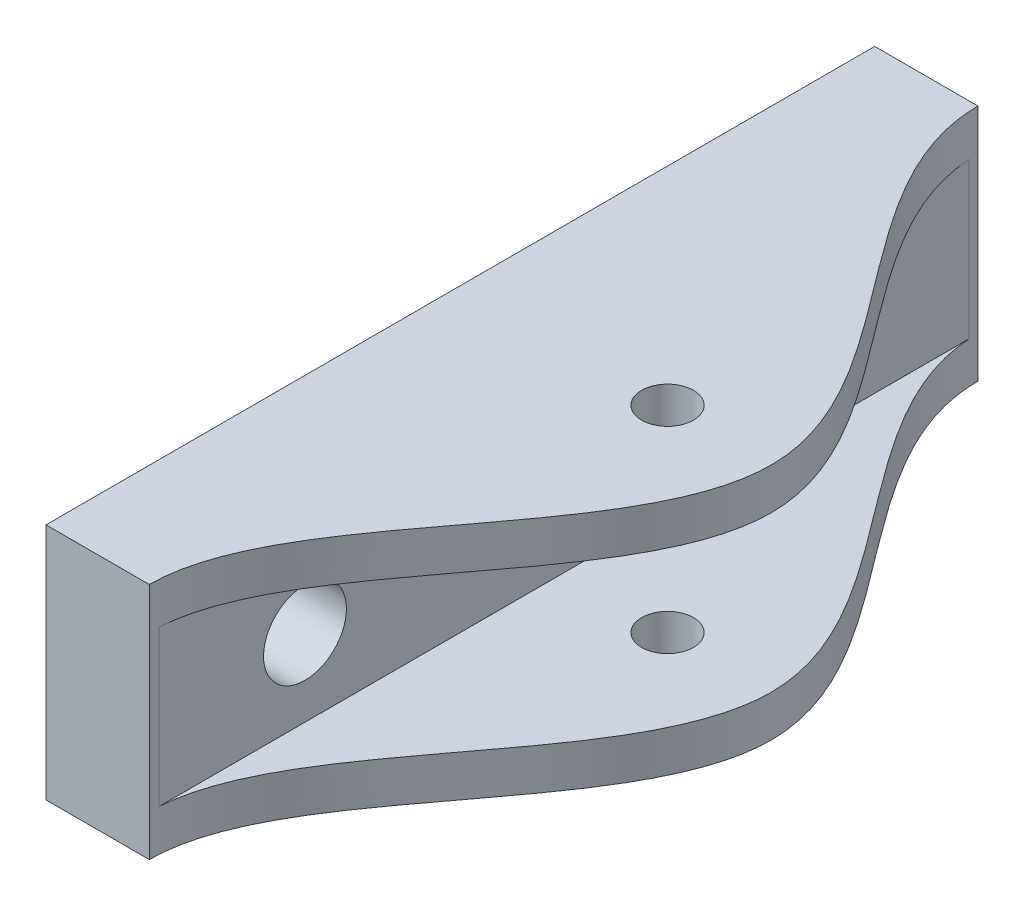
from build123d import *

# Parameters (mm, degrees)
BOSS_EXTRUDE1_DEPTH = 80
SKETCH2_R           = 4
CUT_EXTRUDE1_DEPTH  = 10
SKETCH3_R           = 2.5
CUT_EXTRUDE4_DEPTH  = 23
CUT_EXTRUDE6_DEPTH  = 23


with BuildPart() as part:
    # Sketch1 → Boss-Extrude1 (new body)
    with BuildSketch(Plane.XY):
        Polygon((-44.895114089, -15.378081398), (-44.895114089, -38.378081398), (-14.895114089, -38.378081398), (-14.895114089, -34.378081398), (-34.895114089, -34.378081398), (-34.895114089, -19.378081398), (-14.895114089, -19.378081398), (-14.895114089, -15.378081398), align=None)
    extrude(amount=BOSS_EXTRUDE1_DEPTH)

    # Sketch2 → Cut-Extrude1 (cut)
    with BuildSketch(Plane.ZY.offset(44.895114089)):
        with Locations(Location((15, -26.878081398, 0), (0, 0, 270))):
            Circle(SKETCH2_R)
        with Locations(Location((65, -26.878081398, 0), (0, 0, 270))):
            Circle(SKETCH2_R)
    extrude(amount=-CUT_EXTRUDE1_DEPTH, mode=Mode.SUBTRACT)

    # Sketch3 → Cut-Extrude4 (cut)
    with BuildSketch(Plane(origin=(0, -15.378081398, 0), x_dir=(1, 0, 0), z_dir=(0, 1, 0))):
        with Locations(Location((-24.895114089, -40, 0), (0, 0, 270))):
            Circle(SKETCH3_R)
    extrude(amount=-CUT_EXTRUDE4_DEPTH, mode=Mode.SUBTRACT)

    # Sketch5 → Cut-Extrude6 (cut)
    with BuildSketch(Plane.XZ.offset(38.378081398)):
        with BuildLine():
            Line((-14.895114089, 0), (-13.928238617, 40))
            Line((-13.928238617, 40), (-14.895114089, 80))
            Line((-14.895114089, 80), (-34.925229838, 80))
            add(Edge.make_bspline(
                [(-34.925229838, 0), (-34.925229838, 13.333333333), (5.135001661, 40), (-34.925229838, 66.666666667), (-34.925229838, 80)],
                knots=[0, 0, 0, 0, 0.5, 1, 1, 1, 1], degree=3))
            Line((-34.925229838, 0), (-14.895114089, 0))
        make_face()
    extrude(amount=-CUT_EXTRUDE6_DEPTH, mode=Mode.SUBTRACT)


solid = part.part
